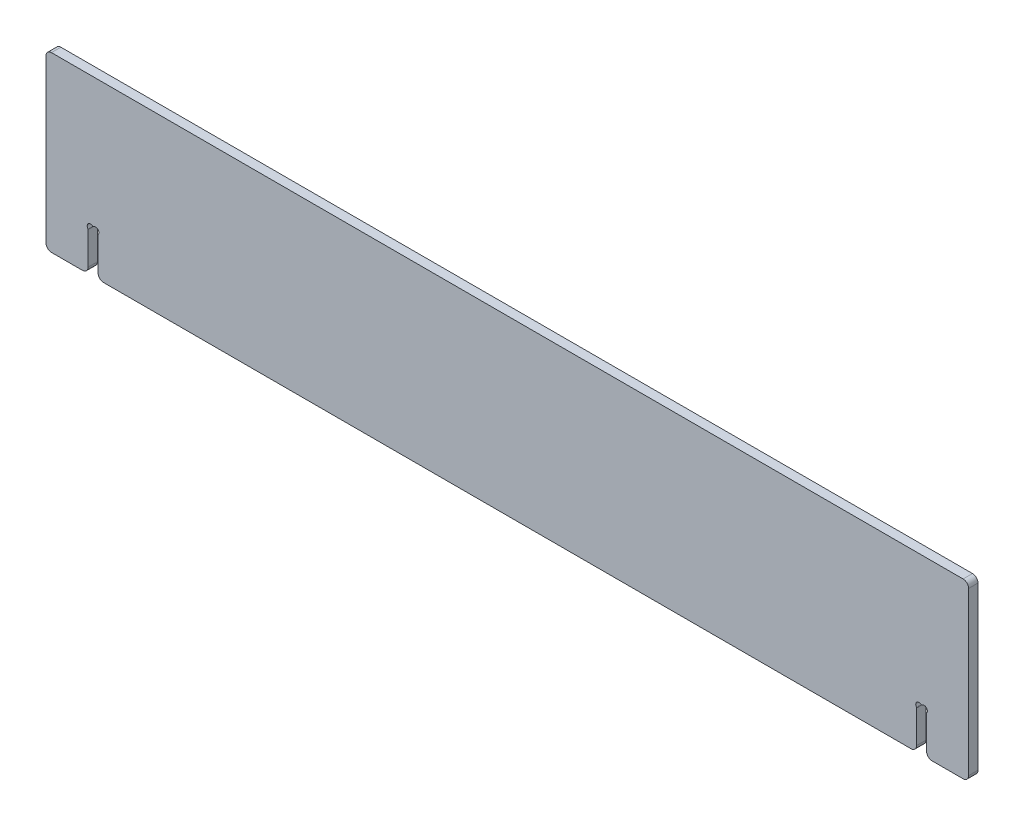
ISO-10303-21;
HEADER;
FILE_DESCRIPTION(('STEP AP214'),'2;1');
FILE_NAME('part.step','',(''),(''),'','','');
FILE_SCHEMA(('AUTOMOTIVE_DESIGN { 1 0 10303 214 1 1 1 1 }'));
ENDSEC;
DATA;
#1=APPLICATION_CONTEXT('core data for automotive mechanical design processes');
#2=APPLICATION_PROTOCOL_DEFINITION('international standard','automotive_design',2000,#1);
#3=PRODUCT_CONTEXT('',#1,'mechanical');
#4=PRODUCT('Part','Part','',(#3));
#5=PRODUCT_RELATED_PRODUCT_CATEGORY('part','',(#4));
#6=PRODUCT_DEFINITION_FORMATION('','',#4);
#7=PRODUCT_DEFINITION_CONTEXT('part definition',#1,'design');
#8=PRODUCT_DEFINITION('design','',#6,#7);
#9=PRODUCT_DEFINITION_SHAPE('','',#8);
#10=(LENGTH_UNIT() NAMED_UNIT(*) SI_UNIT(.MILLI.,.METRE.));
#11=(NAMED_UNIT(*) PLANE_ANGLE_UNIT() SI_UNIT($,.RADIAN.));
#12=(NAMED_UNIT(*) SI_UNIT($,.STERADIAN.) SOLID_ANGLE_UNIT());
#13=UNCERTAINTY_MEASURE_WITH_UNIT(LENGTH_MEASURE(1.E-05),#10,'distance_accuracy_value','');
#14=(GEOMETRIC_REPRESENTATION_CONTEXT(3) GLOBAL_UNCERTAINTY_ASSIGNED_CONTEXT((#13)) GLOBAL_UNIT_ASSIGNED_CONTEXT((#10,
#11,#12)) REPRESENTATION_CONTEXT('',''));
#15=CARTESIAN_POINT('',(0.,0.,0.));
#16=DIRECTION('',(0.,0.,1.));
#17=DIRECTION('',(1.,0.,0.));
#18=AXIS2_PLACEMENT_3D('',#15,#16,#17);
#19=CARTESIAN_POINT('',(0.,220.8,12.));
#20=DIRECTION('',(0.,-1.,0.));
#21=DIRECTION('',(1.,0.,0.));
#22=AXIS2_PLACEMENT_3D('',#19,#20,#21);
#23=PLANE('',#22);
#24=DIRECTION('',(-1.,0.,0.));
#25=VECTOR('',#24,1.);
#26=CARTESIAN_POINT('',(0.,220.8,0.));
#27=LINE('',#26,#25);
#28=CARTESIAN_POINT('',(1170.,220.8,0.));
#29=VERTEX_POINT('',#28);
#30=CARTESIAN_POINT('',(6.9999999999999,220.8,0.));
#31=VERTEX_POINT('',#30);
#32=EDGE_CURVE('E47',#29,#31,#27,.T.);
#33=ORIENTED_EDGE('',*,*,#32,.T.);
#34=DIRECTION('',(0.,0.,-1.));
#35=VECTOR('',#34,1.);
#36=CARTESIAN_POINT('',(6.9999999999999,220.8,12.));
#37=LINE('',#36,#35);
#38=CARTESIAN_POINT('',(6.9999999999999,220.8,12.));
#39=VERTEX_POINT('',#38);
#40=EDGE_CURVE('E487',#31,#39,#37,.F.);
#41=ORIENTED_EDGE('',*,*,#40,.T.);
#42=DIRECTION('',(-1.,0.,0.));
#43=VECTOR('',#42,1.);
#44=CARTESIAN_POINT('',(0.,220.8,12.));
#45=LINE('',#44,#43);
#46=CARTESIAN_POINT('',(1170.,220.8,12.));
#47=VERTEX_POINT('',#46);
#48=EDGE_CURVE('E452',#47,#39,#45,.T.);
#49=ORIENTED_EDGE('',*,*,#48,.F.);
#50=DIRECTION('',(0.,0.,-1.));
#51=VECTOR('',#50,1.);
#52=CARTESIAN_POINT('',(1170.,220.8,12.));
#53=LINE('',#52,#51);
#54=EDGE_CURVE('E368',#29,#47,#53,.F.);
#55=ORIENTED_EDGE('',*,*,#54,.F.);
#56=EDGE_LOOP('',(#33,#41,#49,#55));
#57=FACE_BOUND('',#56,.T.);
#58=ADVANCED_FACE('F32',(#57),#23,.F.);
#59=CARTESIAN_POINT('',(0.,0.,12.));
#60=DIRECTION('',(0.,0.,-1.));
#61=DIRECTION('',(-1.,0.,0.));
#62=AXIS2_PLACEMENT_3D('',#59,#60,#61);
#63=PLANE('',#62);
#64=DIRECTION('',(0.,-1.,0.));
#65=VECTOR('',#64,1.);
#66=CARTESIAN_POINT('',(0.,0.,12.));
#67=LINE('',#66,#65);
#68=CARTESIAN_POINT('',(0.,213.8,12.));
#69=VERTEX_POINT('',#68);
#70=CARTESIAN_POINT('',(0.,7.00000000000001,12.));
#71=VERTEX_POINT('',#70);
#72=EDGE_CURVE('E446',#69,#71,#67,.T.);
#73=ORIENTED_EDGE('',*,*,#72,.T.);
#74=CARTESIAN_POINT('',(6.9999999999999,7.00000000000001,12.));
#75=DIRECTION('',(0.,0.,-1.));
#76=DIRECTION('',(-1.,0.,0.));
#77=AXIS2_PLACEMENT_3D('',#74,#75,#76);
#78=CIRCLE('',#77,7.);
#79=CARTESIAN_POINT('',(6.9999999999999,0.,12.));
#80=VERTEX_POINT('',#79);
#81=EDGE_CURVE('E454',#71,#80,#78,.F.);
#82=ORIENTED_EDGE('',*,*,#81,.T.);
#83=DIRECTION('',(1.,0.,0.));
#84=VECTOR('',#83,1.);
#85=CARTESIAN_POINT('',(0.,0.,12.));
#86=LINE('',#85,#84);
#87=CARTESIAN_POINT('',(46.5505408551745,0.,12.));
#88=VERTEX_POINT('',#87);
#89=EDGE_CURVE('E449',#80,#88,#86,.T.);
#90=ORIENTED_EDGE('',*,*,#89,.T.);
#91=CARTESIAN_POINT('',(46.5505408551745,7.00000000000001,12.));
#92=DIRECTION('',(0.,0.,-1.));
#93=DIRECTION('',(-1.,0.,0.));
#94=AXIS2_PLACEMENT_3D('',#91,#92,#93);
#95=CIRCLE('',#94,7.);
#96=CARTESIAN_POINT('',(53.5503570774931,6.94927669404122,12.));
#97=VERTEX_POINT('',#96);
#98=EDGE_CURVE('E462',#88,#97,#95,.F.);
#99=ORIENTED_EDGE('',*,*,#98,.T.);
#100=DIRECTION('',(-0.00724618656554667,-0.999973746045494,0.));
#101=VECTOR('',#100,1.);
#102=CARTESIAN_POINT('',(53.8529417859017,48.7059664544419,12.));
#103=LINE('',#102,#101);
#104=CARTESIAN_POINT('',(53.8529417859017,48.7059664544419,12.));
#105=VERTEX_POINT('',#104);
#106=EDGE_CURVE('E381',#105,#97,#103,.T.);
#107=ORIENTED_EDGE('',*,*,#106,.F.);
#108=CARTESIAN_POINT('',(52.6529732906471,48.7146618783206,12.));
#109=DIRECTION('',(0.,0.,-1.));
#110=DIRECTION('',(-1.,0.,0.));
#111=AXIS2_PLACEMENT_3D('',#108,#109,#110);
#112=CIRCLE('',#111,1.19999999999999);
#113=CARTESIAN_POINT('',(53.5619227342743,49.4981227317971,12.));
#114=VERTEX_POINT('',#113);
#115=EDGE_CURVE('E425',#114,#105,#112,.T.);
#116=ORIENTED_EDGE('',*,*,#115,.F.);
#117=CARTESIAN_POINT('',(56.6675000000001,52.1749473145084,12.));
#118=DIRECTION('',(0.,0.,1.));
#119=DIRECTION('',(1.,0.,0.));
#120=AXIS2_PLACEMENT_3D('',#117,#118,#119);
#121=CIRCLE('',#120,4.1);
#122=CARTESIAN_POINT('',(59.142842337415,55.4433842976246,12.));
#123=VERTEX_POINT('',#122);
#124=EDGE_CURVE('E422',#123,#114,#121,.T.);
#125=ORIENTED_EDGE('',*,*,#124,.F.);
#126=CARTESIAN_POINT('',(59.8673327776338,56.4000000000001,12.));
#127=DIRECTION('',(0.,0.,-1.));
#128=DIRECTION('',(1.,0.,0.));
#129=AXIS2_PLACEMENT_3D('',#126,#127,#128);
#130=CIRCLE('',#129,1.2);
#131=CARTESIAN_POINT('',(59.8673327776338,55.2,12.));
#132=VERTEX_POINT('',#131);
#133=EDGE_CURVE('E419',#132,#123,#130,.T.);
#134=ORIENTED_EDGE('',*,*,#133,.F.);
#135=DIRECTION('',(-1.,0.,0.));
#136=VECTOR('',#135,1.);
#137=CARTESIAN_POINT('',(59.8673327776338,55.2,12.));
#138=LINE('',#137,#136);
#139=CARTESIAN_POINT('',(60.1326672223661,55.2,12.));
#140=VERTEX_POINT('',#139);
#141=EDGE_CURVE('E416',#140,#132,#138,.T.);
#142=ORIENTED_EDGE('',*,*,#141,.F.);
#143=CARTESIAN_POINT('',(60.1326672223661,56.4000000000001,12.));
#144=DIRECTION('',(0.,0.,-1.));
#145=DIRECTION('',(-1.,0.,0.));
#146=AXIS2_PLACEMENT_3D('',#143,#144,#145);
#147=CIRCLE('',#146,1.2);
#148=CARTESIAN_POINT('',(60.8571576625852,55.4433842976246,12.));
#149=VERTEX_POINT('',#148);
#150=EDGE_CURVE('E413',#149,#140,#147,.T.);
#151=ORIENTED_EDGE('',*,*,#150,.F.);
#152=CARTESIAN_POINT('',(63.3325,52.1749473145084,12.));
#153=DIRECTION('',(0.,0.,1.));
#154=DIRECTION('',(-1.,0.,0.));
#155=AXIS2_PLACEMENT_3D('',#152,#153,#154);
#156=CIRCLE('',#155,4.1);
#157=CARTESIAN_POINT('',(66.4380772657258,49.4981227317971,12.));
#158=VERTEX_POINT('',#157);
#159=EDGE_CURVE('E410',#158,#149,#156,.T.);
#160=ORIENTED_EDGE('',*,*,#159,.F.);
#161=CARTESIAN_POINT('',(67.3470267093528,48.7146618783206,12.));
#162=DIRECTION('',(0.,0.,-1.));
#163=DIRECTION('',(1.,0.,0.));
#164=AXIS2_PLACEMENT_3D('',#161,#162,#163);
#165=CIRCLE('',#164,1.2);
#166=CARTESIAN_POINT('',(66.1470582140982,48.7059664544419,12.));
#167=VERTEX_POINT('',#166);
#168=EDGE_CURVE('E407',#167,#158,#165,.T.);
#169=ORIENTED_EDGE('',*,*,#168,.F.);
#170=DIRECTION('',(-0.00724618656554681,0.999973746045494,0.));
#171=VECTOR('',#170,1.);
#172=CARTESIAN_POINT('',(66.1470582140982,48.7059664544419,12.));
#173=LINE('',#172,#171);
#174=CARTESIAN_POINT('',(66.449642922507,6.94927669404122,12.));
#175=VERTEX_POINT('',#174);
#176=EDGE_CURVE('E377',#175,#167,#173,.T.);
#177=ORIENTED_EDGE('',*,*,#176,.F.);
#178=CARTESIAN_POINT('',(73.4494591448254,7.00000000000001,12.));
#179=DIRECTION('',(0.,0.,-1.));
#180=DIRECTION('',(-1.,0.,0.));
#181=AXIS2_PLACEMENT_3D('',#178,#179,#180);
#182=CIRCLE('',#181,7.);
#183=CARTESIAN_POINT('',(73.4494591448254,0.,12.));
#184=VERTEX_POINT('',#183);
#185=EDGE_CURVE('E466',#175,#184,#182,.F.);
#186=ORIENTED_EDGE('',*,*,#185,.T.);
#187=CARTESIAN_POINT('',(1103.55054085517,0.,12.));
#188=VERTEX_POINT('',#187);
#189=EDGE_CURVE('E448',#184,#188,#86,.T.);
#190=ORIENTED_EDGE('',*,*,#189,.T.);
#191=CARTESIAN_POINT('',(1103.55054085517,7.00000000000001,12.));
#192=DIRECTION('',(0.,0.,1.));
#193=DIRECTION('',(1.,0.,0.));
#194=AXIS2_PLACEMENT_3D('',#191,#192,#193);
#195=CIRCLE('',#194,7.);
#196=CARTESIAN_POINT('',(1110.55035707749,6.94927669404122,12.));
#197=VERTEX_POINT('',#196);
#198=EDGE_CURVE('E343',#197,#188,#195,.F.);
#199=ORIENTED_EDGE('',*,*,#198,.F.);
#200=DIRECTION('',(0.00724618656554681,0.999973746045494,0.));
#201=VECTOR('',#200,1.);
#202=CARTESIAN_POINT('',(1110.8529417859,48.7059664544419,12.));
#203=LINE('',#202,#201);
#204=CARTESIAN_POINT('',(1110.8529417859,48.7059664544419,12.));
#205=VERTEX_POINT('',#204);
#206=EDGE_CURVE('E288',#197,#205,#203,.T.);
#207=ORIENTED_EDGE('',*,*,#206,.T.);
#208=CARTESIAN_POINT('',(1109.65297329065,48.7146618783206,12.));
#209=DIRECTION('',(0.,0.,1.));
#210=DIRECTION('',(-1.,0.,0.));
#211=AXIS2_PLACEMENT_3D('',#208,#209,#210);
#212=CIRCLE('',#211,1.2);
#213=CARTESIAN_POINT('',(1110.56192273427,49.498122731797,12.));
#214=VERTEX_POINT('',#213);
#215=EDGE_CURVE('E291',#205,#214,#212,.T.);
#216=ORIENTED_EDGE('',*,*,#215,.T.);
#217=CARTESIAN_POINT('',(1113.6675,52.1749473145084,12.));
#218=DIRECTION('',(0.,0.,-1.));
#219=DIRECTION('',(1.,0.,0.));
#220=AXIS2_PLACEMENT_3D('',#217,#218,#219);
#221=CIRCLE('',#220,4.1);
#222=CARTESIAN_POINT('',(1116.14284233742,55.4433842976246,12.));
#223=VERTEX_POINT('',#222);
#224=EDGE_CURVE('E250',#214,#223,#221,.T.);
#225=ORIENTED_EDGE('',*,*,#224,.T.);
#226=CARTESIAN_POINT('',(1116.86733277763,56.4000000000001,12.));
#227=DIRECTION('',(0.,0.,1.));
#228=DIRECTION('',(1.,0.,0.));
#229=AXIS2_PLACEMENT_3D('',#226,#227,#228);
#230=CIRCLE('',#229,1.2);
#231=CARTESIAN_POINT('',(1116.86733277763,55.2,12.));
#232=VERTEX_POINT('',#231);
#233=EDGE_CURVE('E294',#223,#232,#230,.T.);
#234=ORIENTED_EDGE('',*,*,#233,.T.);
#235=DIRECTION('',(1.,0.,0.));
#236=VECTOR('',#235,1.);
#237=CARTESIAN_POINT('',(1117.13266722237,55.2,12.));
#238=LINE('',#237,#236);
#239=CARTESIAN_POINT('',(1117.13266722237,55.2,12.));
#240=VERTEX_POINT('',#239);
#241=EDGE_CURVE('E297',#232,#240,#238,.T.);
#242=ORIENTED_EDGE('',*,*,#241,.T.);
#243=CARTESIAN_POINT('',(1117.13266722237,56.4000000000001,12.));
#244=DIRECTION('',(0.,0.,1.));
#245=DIRECTION('',(-1.,0.,0.));
#246=AXIS2_PLACEMENT_3D('',#243,#244,#245);
#247=CIRCLE('',#246,1.2);
#248=CARTESIAN_POINT('',(1117.85715766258,55.4433842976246,12.));
#249=VERTEX_POINT('',#248);
#250=EDGE_CURVE('E300',#240,#249,#247,.T.);
#251=ORIENTED_EDGE('',*,*,#250,.T.);
#252=CARTESIAN_POINT('',(1120.3325,52.1749473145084,12.));
#253=DIRECTION('',(0.,0.,-1.));
#254=DIRECTION('',(-1.,0.,0.));
#255=AXIS2_PLACEMENT_3D('',#252,#253,#254);
#256=CIRCLE('',#255,4.1);
#257=CARTESIAN_POINT('',(1123.43807726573,49.498122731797,12.));
#258=VERTEX_POINT('',#257);
#259=EDGE_CURVE('E303',#249,#258,#256,.T.);
#260=ORIENTED_EDGE('',*,*,#259,.T.);
#261=CARTESIAN_POINT('',(1124.34702670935,48.7146618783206,12.));
#262=DIRECTION('',(0.,0.,1.));
#263=DIRECTION('',(1.,0.,0.));
#264=AXIS2_PLACEMENT_3D('',#261,#262,#263);
#265=CIRCLE('',#264,1.19999999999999);
#266=CARTESIAN_POINT('',(1123.1470582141,48.7059664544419,12.));
#267=VERTEX_POINT('',#266);
#268=EDGE_CURVE('E306',#258,#267,#265,.T.);
#269=ORIENTED_EDGE('',*,*,#268,.T.);
#270=DIRECTION('',(0.00724618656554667,-0.999973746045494,0.));
#271=VECTOR('',#270,1.);
#272=CARTESIAN_POINT('',(1123.1470582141,48.7059664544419,12.));
#273=LINE('',#272,#271);
#274=CARTESIAN_POINT('',(1123.44964292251,6.94927669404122,12.));
#275=VERTEX_POINT('',#274);
#276=EDGE_CURVE('E309',#267,#275,#273,.T.);
#277=ORIENTED_EDGE('',*,*,#276,.T.);
#278=CARTESIAN_POINT('',(1130.44945914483,7.00000000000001,12.));
#279=DIRECTION('',(0.,0.,1.));
#280=DIRECTION('',(1.,0.,0.));
#281=AXIS2_PLACEMENT_3D('',#278,#279,#280);
#282=CIRCLE('',#281,7.);
#283=CARTESIAN_POINT('',(1130.44945914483,0.,12.));
#284=VERTEX_POINT('',#283);
#285=EDGE_CURVE('E337',#284,#275,#282,.F.);
#286=ORIENTED_EDGE('',*,*,#285,.F.);
#287=DIRECTION('',(-1.,0.,0.));
#288=VECTOR('',#287,1.);
#289=CARTESIAN_POINT('',(1177.,0.,12.));
#290=LINE('',#289,#288);
#291=CARTESIAN_POINT('',(1170.,0.,12.));
#292=VERTEX_POINT('',#291);
#293=EDGE_CURVE('E327',#292,#284,#290,.T.);
#294=ORIENTED_EDGE('',*,*,#293,.F.);
#295=CARTESIAN_POINT('',(1170.,7.00000000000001,12.));
#296=DIRECTION('',(0.,0.,1.));
#297=DIRECTION('',(1.,0.,0.));
#298=AXIS2_PLACEMENT_3D('',#295,#296,#297);
#299=CIRCLE('',#298,7.);
#300=CARTESIAN_POINT('',(1177.,7.00000000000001,12.));
#301=VERTEX_POINT('',#300);
#302=EDGE_CURVE('E331',#301,#292,#299,.F.);
#303=ORIENTED_EDGE('',*,*,#302,.F.);
#304=DIRECTION('',(0.,-1.,0.));
#305=VECTOR('',#304,1.);
#306=CARTESIAN_POINT('',(1177.,0.,12.));
#307=LINE('',#306,#305);
#308=CARTESIAN_POINT('',(1177.,213.8,12.));
#309=VERTEX_POINT('',#308);
#310=EDGE_CURVE('E325',#309,#301,#307,.T.);
#311=ORIENTED_EDGE('',*,*,#310,.F.);
#312=CARTESIAN_POINT('',(1170.,213.8,12.));
#313=DIRECTION('',(0.,0.,1.));
#314=DIRECTION('',(1.,0.,0.));
#315=AXIS2_PLACEMENT_3D('',#312,#313,#314);
#316=CIRCLE('',#315,7.);
#317=EDGE_CURVE('E340',#47,#309,#316,.F.);
#318=ORIENTED_EDGE('',*,*,#317,.F.);
#319=ORIENTED_EDGE('',*,*,#48,.T.);
#320=CARTESIAN_POINT('',(6.9999999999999,213.8,12.));
#321=DIRECTION('',(0.,0.,-1.));
#322=DIRECTION('',(-1.,0.,0.));
#323=AXIS2_PLACEMENT_3D('',#320,#321,#322);
#324=CIRCLE('',#323,7.);
#325=EDGE_CURVE('E464',#39,#69,#324,.F.);
#326=ORIENTED_EDGE('',*,*,#325,.T.);
#327=EDGE_LOOP('',(#73,#82,#90,#99,#107,#116,#125,#134,#142,#151,#160,#169,#177,#186,#190,#199,
#207,#216,#225,#234,#242,#251,#260,#269,#277,#286,#294,#303,#311,#318,#319,#326));
#328=FACE_BOUND('',#327,.T.);
#329=ADVANCED_FACE('F501',(#328),#63,.F.);
#330=CARTESIAN_POINT('',(0.,0.,0.));
#331=DIRECTION('',(0.,0.,-1.));
#332=DIRECTION('',(-1.,0.,0.));
#333=AXIS2_PLACEMENT_3D('',#330,#331,#332);
#334=PLANE('',#333);
#335=CARTESIAN_POINT('',(6.9999999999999,7.00000000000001,0.));
#336=DIRECTION('',(0.,0.,-1.));
#337=DIRECTION('',(-1.,0.,0.));
#338=AXIS2_PLACEMENT_3D('',#335,#336,#337);
#339=CIRCLE('',#338,7.);
#340=CARTESIAN_POINT('',(6.9999999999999,0.,0.));
#341=VERTEX_POINT('',#340);
#342=CARTESIAN_POINT('',(0.,7.00000000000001,0.));
#343=VERTEX_POINT('',#342);
#344=EDGE_CURVE('E469',#341,#343,#339,.T.);
#345=ORIENTED_EDGE('',*,*,#344,.T.);
#346=DIRECTION('',(0.,-1.,0.));
#347=VECTOR('',#346,1.);
#348=CARTESIAN_POINT('',(0.,0.,0.));
#349=LINE('',#348,#347);
#350=CARTESIAN_POINT('',(0.,213.8,0.));
#351=VERTEX_POINT('',#350);
#352=EDGE_CURVE('E55',#351,#343,#349,.T.);
#353=ORIENTED_EDGE('',*,*,#352,.F.);
#354=CARTESIAN_POINT('',(6.9999999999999,213.8,0.));
#355=DIRECTION('',(0.,0.,-1.));
#356=DIRECTION('',(-1.,0.,0.));
#357=AXIS2_PLACEMENT_3D('',#354,#355,#356);
#358=CIRCLE('',#357,7.);
#359=EDGE_CURVE('E473',#351,#31,#358,.T.);
#360=ORIENTED_EDGE('',*,*,#359,.T.);
#361=ORIENTED_EDGE('',*,*,#32,.F.);
#362=CARTESIAN_POINT('',(1170.,213.8,0.));
#363=DIRECTION('',(0.,0.,1.));
#364=DIRECTION('',(1.,0.,0.));
#365=AXIS2_PLACEMENT_3D('',#362,#363,#364);
#366=CIRCLE('',#365,7.);
#367=CARTESIAN_POINT('',(1177.,213.8,0.));
#368=VERTEX_POINT('',#367);
#369=EDGE_CURVE('E352',#368,#29,#366,.T.);
#370=ORIENTED_EDGE('',*,*,#369,.F.);
#371=DIRECTION('',(0.,-1.,0.));
#372=VECTOR('',#371,1.);
#373=CARTESIAN_POINT('',(1177.,0.,0.));
#374=LINE('',#373,#372);
#375=CARTESIAN_POINT('',(1177.,7.00000000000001,0.));
#376=VERTEX_POINT('',#375);
#377=EDGE_CURVE('E314',#368,#376,#374,.T.);
#378=ORIENTED_EDGE('',*,*,#377,.T.);
#379=CARTESIAN_POINT('',(1170.,7.00000000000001,0.));
#380=DIRECTION('',(0.,0.,1.));
#381=DIRECTION('',(1.,0.,0.));
#382=AXIS2_PLACEMENT_3D('',#379,#380,#381);
#383=CIRCLE('',#382,7.);
#384=CARTESIAN_POINT('',(1170.,0.,0.));
#385=VERTEX_POINT('',#384);
#386=EDGE_CURVE('E346',#385,#376,#383,.T.);
#387=ORIENTED_EDGE('',*,*,#386,.F.);
#388=DIRECTION('',(-1.,0.,0.));
#389=VECTOR('',#388,1.);
#390=CARTESIAN_POINT('',(1177.,0.,0.));
#391=LINE('',#390,#389);
#392=CARTESIAN_POINT('',(1130.44945914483,0.,0.));
#393=VERTEX_POINT('',#392);
#394=EDGE_CURVE('E328',#385,#393,#391,.T.);
#395=ORIENTED_EDGE('',*,*,#394,.T.);
#396=CARTESIAN_POINT('',(1130.44945914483,7.00000000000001,0.));
#397=DIRECTION('',(0.,0.,1.));
#398=DIRECTION('',(1.,0.,0.));
#399=AXIS2_PLACEMENT_3D('',#396,#397,#398);
#400=CIRCLE('',#399,7.);
#401=CARTESIAN_POINT('',(1123.44964292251,6.94927669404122,0.));
#402=VERTEX_POINT('',#401);
#403=EDGE_CURVE('E349',#402,#393,#400,.T.);
#404=ORIENTED_EDGE('',*,*,#403,.F.);
#405=DIRECTION('',(0.00724618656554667,-0.999973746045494,0.));
#406=VECTOR('',#405,1.);
#407=CARTESIAN_POINT('',(1123.1470582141,48.7059664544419,0.));
#408=LINE('',#407,#406);
#409=CARTESIAN_POINT('',(1123.1470582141,48.7059664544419,0.));
#410=VERTEX_POINT('',#409);
#411=EDGE_CURVE('E285',#410,#402,#408,.T.);
#412=ORIENTED_EDGE('',*,*,#411,.F.);
#413=CARTESIAN_POINT('',(1124.34702670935,48.7146618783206,0.));
#414=DIRECTION('',(0.,0.,1.));
#415=DIRECTION('',(1.,0.,0.));
#416=AXIS2_PLACEMENT_3D('',#413,#414,#415);
#417=CIRCLE('',#416,1.19999999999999);
#418=CARTESIAN_POINT('',(1123.43807726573,49.498122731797,0.));
#419=VERTEX_POINT('',#418);
#420=EDGE_CURVE('E282',#419,#410,#417,.T.);
#421=ORIENTED_EDGE('',*,*,#420,.F.);
#422=CARTESIAN_POINT('',(1120.3325,52.1749473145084,0.));
#423=DIRECTION('',(0.,0.,-1.));
#424=DIRECTION('',(-1.,0.,0.));
#425=AXIS2_PLACEMENT_3D('',#422,#423,#424);
#426=CIRCLE('',#425,4.1);
#427=CARTESIAN_POINT('',(1117.85715766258,55.4433842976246,0.));
#428=VERTEX_POINT('',#427);
#429=EDGE_CURVE('E279',#428,#419,#426,.T.);
#430=ORIENTED_EDGE('',*,*,#429,.F.);
#431=CARTESIAN_POINT('',(1117.13266722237,56.4000000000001,0.));
#432=DIRECTION('',(0.,0.,1.));
#433=DIRECTION('',(-1.,0.,0.));
#434=AXIS2_PLACEMENT_3D('',#431,#432,#433);
#435=CIRCLE('',#434,1.2);
#436=CARTESIAN_POINT('',(1117.13266722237,55.2,0.));
#437=VERTEX_POINT('',#436);
#438=EDGE_CURVE('E276',#437,#428,#435,.T.);
#439=ORIENTED_EDGE('',*,*,#438,.F.);
#440=DIRECTION('',(1.,0.,0.));
#441=VECTOR('',#440,1.);
#442=CARTESIAN_POINT('',(1117.13266722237,55.2,0.));
#443=LINE('',#442,#441);
#444=CARTESIAN_POINT('',(1116.86733277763,55.2,0.));
#445=VERTEX_POINT('',#444);
#446=EDGE_CURVE('E270',#445,#437,#443,.T.);
#447=ORIENTED_EDGE('',*,*,#446,.F.);
#448=CARTESIAN_POINT('',(1116.86733277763,56.4000000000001,0.));
#449=DIRECTION('',(0.,0.,1.));
#450=DIRECTION('',(1.,0.,0.));
#451=AXIS2_PLACEMENT_3D('',#448,#449,#450);
#452=CIRCLE('',#451,1.2);
#453=CARTESIAN_POINT('',(1116.14284233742,55.4433842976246,0.));
#454=VERTEX_POINT('',#453);
#455=EDGE_CURVE('E268',#454,#445,#452,.T.);
#456=ORIENTED_EDGE('',*,*,#455,.F.);
#457=CARTESIAN_POINT('',(1113.6675,52.1749473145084,0.));
#458=DIRECTION('',(0.,0.,-1.));
#459=DIRECTION('',(1.,0.,0.));
#460=AXIS2_PLACEMENT_3D('',#457,#458,#459);
#461=CIRCLE('',#460,4.1);
#462=CARTESIAN_POINT('',(1110.56192273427,49.498122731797,0.));
#463=VERTEX_POINT('',#462);
#464=EDGE_CURVE('E247',#463,#454,#461,.T.);
#465=ORIENTED_EDGE('',*,*,#464,.F.);
#466=CARTESIAN_POINT('',(1109.65297329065,48.7146618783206,0.));
#467=DIRECTION('',(0.,0.,1.));
#468=DIRECTION('',(-1.,0.,0.));
#469=AXIS2_PLACEMENT_3D('',#466,#467,#468);
#470=CIRCLE('',#469,1.2);
#471=CARTESIAN_POINT('',(1110.8529417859,48.7059664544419,0.));
#472=VERTEX_POINT('',#471);
#473=EDGE_CURVE('E258',#472,#463,#470,.T.);
#474=ORIENTED_EDGE('',*,*,#473,.F.);
#475=DIRECTION('',(0.00724618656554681,0.999973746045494,0.));
#476=VECTOR('',#475,1.);
#477=CARTESIAN_POINT('',(1110.8529417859,48.7059664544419,0.));
#478=LINE('',#477,#476);
#479=CARTESIAN_POINT('',(1110.55035707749,6.94927669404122,0.));
#480=VERTEX_POINT('',#479);
#481=EDGE_CURVE('E263',#480,#472,#478,.T.);
#482=ORIENTED_EDGE('',*,*,#481,.F.);
#483=CARTESIAN_POINT('',(1103.55054085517,7.00000000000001,0.));
#484=DIRECTION('',(0.,0.,1.));
#485=DIRECTION('',(1.,0.,0.));
#486=AXIS2_PLACEMENT_3D('',#483,#484,#485);
#487=CIRCLE('',#486,7.);
#488=CARTESIAN_POINT('',(1103.55054085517,0.,0.));
#489=VERTEX_POINT('',#488);
#490=EDGE_CURVE('E355',#489,#480,#487,.T.);
#491=ORIENTED_EDGE('',*,*,#490,.F.);
#492=DIRECTION('',(1.,0.,0.));
#493=VECTOR('',#492,1.);
#494=CARTESIAN_POINT('',(0.,0.,0.));
#495=LINE('',#494,#493);
#496=CARTESIAN_POINT('',(73.4494591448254,0.,0.));
#497=VERTEX_POINT('',#496);
#498=EDGE_CURVE('E456',#497,#489,#495,.T.);
#499=ORIENTED_EDGE('',*,*,#498,.F.);
#500=CARTESIAN_POINT('',(73.4494591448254,7.00000000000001,0.));
#501=DIRECTION('',(0.,0.,-1.));
#502=DIRECTION('',(-1.,0.,0.));
#503=AXIS2_PLACEMENT_3D('',#500,#501,#502);
#504=CIRCLE('',#503,7.);
#505=CARTESIAN_POINT('',(66.449642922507,6.94927669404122,0.));
#506=VERTEX_POINT('',#505);
#507=EDGE_CURVE('E475',#497,#506,#504,.T.);
#508=ORIENTED_EDGE('',*,*,#507,.T.);
#509=DIRECTION('',(-0.00724618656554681,0.999973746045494,0.));
#510=VECTOR('',#509,1.);
#511=CARTESIAN_POINT('',(66.1470582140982,48.7059664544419,0.));
#512=LINE('',#511,#510);
#513=CARTESIAN_POINT('',(66.1470582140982,48.7059664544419,0.));
#514=VERTEX_POINT('',#513);
#515=EDGE_CURVE('E378',#506,#514,#512,.T.);
#516=ORIENTED_EDGE('',*,*,#515,.T.);
#517=CARTESIAN_POINT('',(67.3470267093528,48.7146618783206,0.));
#518=DIRECTION('',(0.,0.,-1.));
#519=DIRECTION('',(1.,0.,0.));
#520=AXIS2_PLACEMENT_3D('',#517,#518,#519);
#521=CIRCLE('',#520,1.2);
#522=CARTESIAN_POINT('',(66.4380772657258,49.4981227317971,0.));
#523=VERTEX_POINT('',#522);
#524=EDGE_CURVE('E380',#514,#523,#521,.T.);
#525=ORIENTED_EDGE('',*,*,#524,.T.);
#526=CARTESIAN_POINT('',(63.3325,52.1749473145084,0.));
#527=DIRECTION('',(0.,0.,1.));
#528=DIRECTION('',(-1.,0.,0.));
#529=AXIS2_PLACEMENT_3D('',#526,#527,#528);
#530=CIRCLE('',#529,4.1);
#531=CARTESIAN_POINT('',(60.8571576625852,55.4433842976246,0.));
#532=VERTEX_POINT('',#531);
#533=EDGE_CURVE('E384',#523,#532,#530,.T.);
#534=ORIENTED_EDGE('',*,*,#533,.T.);
#535=CARTESIAN_POINT('',(60.1326672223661,56.4000000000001,0.));
#536=DIRECTION('',(0.,0.,-1.));
#537=DIRECTION('',(-1.,0.,0.));
#538=AXIS2_PLACEMENT_3D('',#535,#536,#537);
#539=CIRCLE('',#538,1.2);
#540=CARTESIAN_POINT('',(60.1326672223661,55.2,0.));
#541=VERTEX_POINT('',#540);
#542=EDGE_CURVE('E387',#532,#541,#539,.T.);
#543=ORIENTED_EDGE('',*,*,#542,.T.);
#544=DIRECTION('',(-1.,0.,0.));
#545=VECTOR('',#544,1.);
#546=CARTESIAN_POINT('',(59.8673327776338,55.2,0.));
#547=LINE('',#546,#545);
#548=CARTESIAN_POINT('',(59.8673327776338,55.2,0.));
#549=VERTEX_POINT('',#548);
#550=EDGE_CURVE('E390',#541,#549,#547,.T.);
#551=ORIENTED_EDGE('',*,*,#550,.T.);
#552=CARTESIAN_POINT('',(59.8673327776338,56.4000000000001,0.));
#553=DIRECTION('',(0.,0.,-1.));
#554=DIRECTION('',(1.,0.,0.));
#555=AXIS2_PLACEMENT_3D('',#552,#553,#554);
#556=CIRCLE('',#555,1.2);
#557=CARTESIAN_POINT('',(59.142842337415,55.4433842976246,0.));
#558=VERTEX_POINT('',#557);
#559=EDGE_CURVE('E393',#549,#558,#556,.T.);
#560=ORIENTED_EDGE('',*,*,#559,.T.);
#561=CARTESIAN_POINT('',(56.6675000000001,52.1749473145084,0.));
#562=DIRECTION('',(0.,0.,1.));
#563=DIRECTION('',(1.,0.,0.));
#564=AXIS2_PLACEMENT_3D('',#561,#562,#563);
#565=CIRCLE('',#564,4.1);
#566=CARTESIAN_POINT('',(53.5619227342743,49.4981227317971,0.));
#567=VERTEX_POINT('',#566);
#568=EDGE_CURVE('E396',#558,#567,#565,.T.);
#569=ORIENTED_EDGE('',*,*,#568,.T.);
#570=CARTESIAN_POINT('',(52.6529732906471,48.7146618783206,0.));
#571=DIRECTION('',(0.,0.,-1.));
#572=DIRECTION('',(-1.,0.,0.));
#573=AXIS2_PLACEMENT_3D('',#570,#571,#572);
#574=CIRCLE('',#573,1.19999999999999);
#575=CARTESIAN_POINT('',(53.8529417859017,48.7059664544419,0.));
#576=VERTEX_POINT('',#575);
#577=EDGE_CURVE('E399',#567,#576,#574,.T.);
#578=ORIENTED_EDGE('',*,*,#577,.T.);
#579=DIRECTION('',(-0.00724618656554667,-0.999973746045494,0.));
#580=VECTOR('',#579,1.);
#581=CARTESIAN_POINT('',(53.8529417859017,48.7059664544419,0.));
#582=LINE('',#581,#580);
#583=CARTESIAN_POINT('',(53.5503570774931,6.94927669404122,0.));
#584=VERTEX_POINT('',#583);
#585=EDGE_CURVE('E402',#576,#584,#582,.T.);
#586=ORIENTED_EDGE('',*,*,#585,.T.);
#587=CARTESIAN_POINT('',(46.5505408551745,7.00000000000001,0.));
#588=DIRECTION('',(0.,0.,-1.));
#589=DIRECTION('',(-1.,0.,0.));
#590=AXIS2_PLACEMENT_3D('',#587,#588,#589);
#591=CIRCLE('',#590,7.);
#592=CARTESIAN_POINT('',(46.5505408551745,0.,0.));
#593=VERTEX_POINT('',#592);
#594=EDGE_CURVE('E471',#584,#593,#591,.T.);
#595=ORIENTED_EDGE('',*,*,#594,.T.);
#596=EDGE_CURVE('E457',#341,#593,#495,.T.);
#597=ORIENTED_EDGE('',*,*,#596,.F.);
#598=EDGE_LOOP('',(#345,#353,#360,#361,#370,#378,#387,#395,#404,#412,#421,#430,#439,#447,#456,
#465,#474,#482,#491,#499,#508,#516,#525,#534,#543,#551,#560,#569,#578,#586,#595,#597));
#599=FACE_BOUND('',#598,.T.);
#600=ADVANCED_FACE('F265',(#599),#334,.T.);
#601=CARTESIAN_POINT('',(0.,0.,12.));
#602=DIRECTION('',(0.,1.,0.));
#603=DIRECTION('',(0.,0.,1.));
#604=AXIS2_PLACEMENT_3D('',#601,#602,#603);
#605=PLANE('',#604);
#606=ORIENTED_EDGE('',*,*,#596,.T.);
#607=DIRECTION('',(0.,0.,1.));
#608=VECTOR('',#607,1.);
#609=CARTESIAN_POINT('',(46.5505408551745,0.,12.));
#610=LINE('',#609,#608);
#611=EDGE_CURVE('E40',#593,#88,#610,.T.);
#612=ORIENTED_EDGE('',*,*,#611,.T.);
#613=ORIENTED_EDGE('',*,*,#89,.F.);
#614=DIRECTION('',(0.,0.,-1.));
#615=VECTOR('',#614,1.);
#616=CARTESIAN_POINT('',(6.9999999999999,0.,12.));
#617=LINE('',#616,#615);
#618=EDGE_CURVE('E489',#80,#341,#617,.T.);
#619=ORIENTED_EDGE('',*,*,#618,.T.);
#620=EDGE_LOOP('',(#606,#612,#613,#619));
#621=FACE_BOUND('',#620,.T.);
#622=ADVANCED_FACE('F495',(#621),#605,.F.);
#623=CARTESIAN_POINT('',(0.,0.,12.));
#624=DIRECTION('',(1.,0.,0.));
#625=DIRECTION('',(0.,0.,-1.));
#626=AXIS2_PLACEMENT_3D('',#623,#624,#625);
#627=PLANE('',#626);
#628=DIRECTION('',(0.,0.,-1.));
#629=VECTOR('',#628,1.);
#630=CARTESIAN_POINT('',(0.,7.00000000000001,12.));
#631=LINE('',#630,#629);
#632=EDGE_CURVE('E483',#343,#71,#631,.F.);
#633=ORIENTED_EDGE('',*,*,#632,.T.);
#634=ORIENTED_EDGE('',*,*,#72,.F.);
#635=DIRECTION('',(0.,0.,-1.));
#636=VECTOR('',#635,1.);
#637=CARTESIAN_POINT('',(0.,213.8,12.));
#638=LINE('',#637,#636);
#639=EDGE_CURVE('E485',#69,#351,#638,.T.);
#640=ORIENTED_EDGE('',*,*,#639,.T.);
#641=ORIENTED_EDGE('',*,*,#352,.T.);
#642=EDGE_LOOP('',(#633,#634,#640,#641));
#643=FACE_BOUND('',#642,.T.);
#644=ADVANCED_FACE('F607',(#643),#627,.F.);
#645=DIRECTION('',(0.,0.,1.));
#646=VECTOR('',#645,1.);
#647=CARTESIAN_POINT('',(1103.55054085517,0.,12.));
#648=LINE('',#647,#646);
#649=EDGE_CURVE('E360',#188,#489,#648,.F.);
#650=ORIENTED_EDGE('',*,*,#649,.F.);
#651=ORIENTED_EDGE('',*,*,#189,.F.);
#652=DIRECTION('',(0.,0.,1.));
#653=VECTOR('',#652,1.);
#654=CARTESIAN_POINT('',(73.4494591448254,0.,12.));
#655=LINE('',#654,#653);
#656=EDGE_CURVE('E480',#184,#497,#655,.F.);
#657=ORIENTED_EDGE('',*,*,#656,.T.);
#658=ORIENTED_EDGE('',*,*,#498,.T.);
#659=EDGE_LOOP('',(#650,#651,#657,#658));
#660=FACE_BOUND('',#659,.T.);
#661=ADVANCED_FACE('F556',(#660),#605,.F.);
#662=CARTESIAN_POINT('',(53.8529417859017,48.7059664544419,0.));
#663=DIRECTION('',(-0.999973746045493,0.00724618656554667,0.));
#664=DIRECTION('',(-0.00724618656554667,-0.999973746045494,0.));
#665=AXIS2_PLACEMENT_3D('',#662,#663,#664);
#666=PLANE('',#665);
#667=ORIENTED_EDGE('',*,*,#106,.T.);
#668=DIRECTION('',(0.,0.,1.));
#669=VECTOR('',#668,1.);
#670=CARTESIAN_POINT('',(53.5503570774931,6.94927669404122,0.));
#671=LINE('',#670,#669);
#672=EDGE_CURVE('E11',#97,#584,#671,.F.);
#673=ORIENTED_EDGE('',*,*,#672,.T.);
#674=ORIENTED_EDGE('',*,*,#585,.F.);
#675=DIRECTION('',(0.,0.,1.));
#676=VECTOR('',#675,1.);
#677=CARTESIAN_POINT('',(53.8529417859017,48.7059664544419,0.));
#678=LINE('',#677,#676);
#679=EDGE_CURVE('E430',#576,#105,#678,.T.);
#680=ORIENTED_EDGE('',*,*,#679,.T.);
#681=EDGE_LOOP('',(#667,#673,#674,#680));
#682=FACE_BOUND('',#681,.T.);
#683=ADVANCED_FACE('F511',(#682),#666,.F.);
#684=CARTESIAN_POINT('',(52.6529732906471,48.7146618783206,0.));
#685=DIRECTION('',(0.,0.,1.));
#686=DIRECTION('',(1.,0.,0.));
#687=AXIS2_PLACEMENT_3D('',#684,#685,#686);
#688=CYLINDRICAL_SURFACE('',#687,1.19999999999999);
#689=ORIENTED_EDGE('',*,*,#115,.T.);
#690=ORIENTED_EDGE('',*,*,#679,.F.);
#691=ORIENTED_EDGE('',*,*,#577,.F.);
#692=DIRECTION('',(0.,0.,1.));
#693=VECTOR('',#692,1.);
#694=CARTESIAN_POINT('',(53.5619227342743,49.4981227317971,0.));
#695=LINE('',#694,#693);
#696=EDGE_CURVE('E432',#567,#114,#695,.T.);
#697=ORIENTED_EDGE('',*,*,#696,.T.);
#698=EDGE_LOOP('',(#689,#690,#691,#697));
#699=FACE_BOUND('',#698,.T.);
#700=ADVANCED_FACE('F516',(#699),#688,.T.);
#701=CARTESIAN_POINT('',(56.6675000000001,52.1749473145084,0.));
#702=DIRECTION('',(0.,0.,1.));
#703=DIRECTION('',(1.,0.,0.));
#704=AXIS2_PLACEMENT_3D('',#701,#702,#703);
#705=CYLINDRICAL_SURFACE('',#704,4.1);
#706=ORIENTED_EDGE('',*,*,#124,.T.);
#707=ORIENTED_EDGE('',*,*,#696,.F.);
#708=ORIENTED_EDGE('',*,*,#568,.F.);
#709=DIRECTION('',(0.,0.,1.));
#710=VECTOR('',#709,1.);
#711=CARTESIAN_POINT('',(59.142842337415,55.4433842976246,0.));
#712=LINE('',#711,#710);
#713=EDGE_CURVE('E434',#558,#123,#712,.T.);
#714=ORIENTED_EDGE('',*,*,#713,.T.);
#715=EDGE_LOOP('',(#706,#707,#708,#714));
#716=FACE_BOUND('',#715,.T.);
#717=ADVANCED_FACE('F520',(#716),#705,.F.);
#718=CARTESIAN_POINT('',(59.8673327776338,56.4000000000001,0.));
#719=DIRECTION('',(0.,0.,1.));
#720=DIRECTION('',(1.,0.,0.));
#721=AXIS2_PLACEMENT_3D('',#718,#719,#720);
#722=CYLINDRICAL_SURFACE('',#721,1.2);
#723=ORIENTED_EDGE('',*,*,#133,.T.);
#724=ORIENTED_EDGE('',*,*,#713,.F.);
#725=ORIENTED_EDGE('',*,*,#559,.F.);
#726=DIRECTION('',(0.,0.,1.));
#727=VECTOR('',#726,1.);
#728=CARTESIAN_POINT('',(59.8673327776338,55.2,0.));
#729=LINE('',#728,#727);
#730=EDGE_CURVE('E436',#549,#132,#729,.T.);
#731=ORIENTED_EDGE('',*,*,#730,.T.);
#732=EDGE_LOOP('',(#723,#724,#725,#731));
#733=FACE_BOUND('',#732,.T.);
#734=ADVANCED_FACE('F523',(#733),#722,.T.);
#735=CARTESIAN_POINT('',(59.8673327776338,55.2,0.));
#736=DIRECTION('',(0.,1.,0.));
#737=DIRECTION('',(0.,0.,1.));
#738=AXIS2_PLACEMENT_3D('',#735,#736,#737);
#739=PLANE('',#738);
#740=ORIENTED_EDGE('',*,*,#141,.T.);
#741=ORIENTED_EDGE('',*,*,#730,.F.);
#742=ORIENTED_EDGE('',*,*,#550,.F.);
#743=DIRECTION('',(0.,0.,1.));
#744=VECTOR('',#743,1.);
#745=CARTESIAN_POINT('',(60.1326672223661,55.2,0.));
#746=LINE('',#745,#744);
#747=EDGE_CURVE('E438',#541,#140,#746,.T.);
#748=ORIENTED_EDGE('',*,*,#747,.T.);
#749=EDGE_LOOP('',(#740,#741,#742,#748));
#750=FACE_BOUND('',#749,.T.);
#751=ADVANCED_FACE('F528',(#750),#739,.F.);
#752=CARTESIAN_POINT('',(60.1326672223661,56.4000000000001,0.));
#753=DIRECTION('',(0.,0.,1.));
#754=DIRECTION('',(1.,0.,0.));
#755=AXIS2_PLACEMENT_3D('',#752,#753,#754);
#756=CYLINDRICAL_SURFACE('',#755,1.2);
#757=ORIENTED_EDGE('',*,*,#150,.T.);
#758=ORIENTED_EDGE('',*,*,#747,.F.);
#759=ORIENTED_EDGE('',*,*,#542,.F.);
#760=DIRECTION('',(0.,0.,1.));
#761=VECTOR('',#760,1.);
#762=CARTESIAN_POINT('',(60.8571576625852,55.4433842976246,0.));
#763=LINE('',#762,#761);
#764=EDGE_CURVE('E440',#532,#149,#763,.T.);
#765=ORIENTED_EDGE('',*,*,#764,.T.);
#766=EDGE_LOOP('',(#757,#758,#759,#765));
#767=FACE_BOUND('',#766,.T.);
#768=ADVANCED_FACE('F532',(#767),#756,.T.);
#769=CARTESIAN_POINT('',(63.3325,52.1749473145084,0.));
#770=DIRECTION('',(0.,0.,1.));
#771=DIRECTION('',(1.,0.,0.));
#772=AXIS2_PLACEMENT_3D('',#769,#770,#771);
#773=CYLINDRICAL_SURFACE('',#772,4.1);
#774=ORIENTED_EDGE('',*,*,#159,.T.);
#775=ORIENTED_EDGE('',*,*,#764,.F.);
#776=ORIENTED_EDGE('',*,*,#533,.F.);
#777=DIRECTION('',(0.,0.,1.));
#778=VECTOR('',#777,1.);
#779=CARTESIAN_POINT('',(66.4380772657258,49.4981227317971,0.));
#780=LINE('',#779,#778);
#781=EDGE_CURVE('E442',#523,#158,#780,.T.);
#782=ORIENTED_EDGE('',*,*,#781,.T.);
#783=EDGE_LOOP('',(#774,#775,#776,#782));
#784=FACE_BOUND('',#783,.T.);
#785=ADVANCED_FACE('F535',(#784),#773,.F.);
#786=CARTESIAN_POINT('',(67.3470267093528,48.7146618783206,0.));
#787=DIRECTION('',(0.,0.,1.));
#788=DIRECTION('',(1.,0.,0.));
#789=AXIS2_PLACEMENT_3D('',#786,#787,#788);
#790=CYLINDRICAL_SURFACE('',#789,1.2);
#791=ORIENTED_EDGE('',*,*,#168,.T.);
#792=ORIENTED_EDGE('',*,*,#781,.F.);
#793=ORIENTED_EDGE('',*,*,#524,.F.);
#794=DIRECTION('',(0.,0.,1.));
#795=VECTOR('',#794,1.);
#796=CARTESIAN_POINT('',(66.1470582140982,48.7059664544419,0.));
#797=LINE('',#796,#795);
#798=EDGE_CURVE('E405',#514,#167,#797,.T.);
#799=ORIENTED_EDGE('',*,*,#798,.T.);
#800=EDGE_LOOP('',(#791,#792,#793,#799));
#801=FACE_BOUND('',#800,.T.);
#802=ADVANCED_FACE('F539',(#801),#790,.T.);
#803=CARTESIAN_POINT('',(66.1470582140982,48.7059664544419,0.));
#804=DIRECTION('',(0.999973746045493,0.00724618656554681,0.));
#805=DIRECTION('',(-0.00724618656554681,0.999973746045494,0.));
#806=AXIS2_PLACEMENT_3D('',#803,#804,#805);
#807=PLANE('',#806);
#808=ORIENTED_EDGE('',*,*,#515,.F.);
#809=DIRECTION('',(0.,0.,1.));
#810=VECTOR('',#809,1.);
#811=CARTESIAN_POINT('',(66.449642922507,6.94927669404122,0.));
#812=LINE('',#811,#810);
#813=EDGE_CURVE('E477',#506,#175,#812,.T.);
#814=ORIENTED_EDGE('',*,*,#813,.T.);
#815=ORIENTED_EDGE('',*,*,#176,.T.);
#816=ORIENTED_EDGE('',*,*,#798,.F.);
#817=EDGE_LOOP('',(#808,#814,#815,#816));
#818=FACE_BOUND('',#817,.T.);
#819=ADVANCED_FACE('F544',(#818),#807,.F.);
#820=CARTESIAN_POINT('',(73.4494591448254,7.00000000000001,0.));
#821=DIRECTION('',(0.,0.,1.));
#822=DIRECTION('',(1.,0.,0.));
#823=AXIS2_PLACEMENT_3D('',#820,#821,#822);
#824=CYLINDRICAL_SURFACE('',#823,7.);
#825=ORIENTED_EDGE('',*,*,#507,.F.);
#826=ORIENTED_EDGE('',*,*,#656,.F.);
#827=ORIENTED_EDGE('',*,*,#185,.F.);
#828=ORIENTED_EDGE('',*,*,#813,.F.);
#829=EDGE_LOOP('',(#825,#826,#827,#828));
#830=FACE_BOUND('',#829,.T.);
#831=ADVANCED_FACE('F548',(#830),#824,.T.);
#832=CARTESIAN_POINT('',(6.9999999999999,213.8,12.));
#833=DIRECTION('',(0.,0.,-1.));
#834=DIRECTION('',(-1.,0.,0.));
#835=AXIS2_PLACEMENT_3D('',#832,#833,#834);
#836=CYLINDRICAL_SURFACE('',#835,7.);
#837=ORIENTED_EDGE('',*,*,#325,.F.);
#838=ORIENTED_EDGE('',*,*,#40,.F.);
#839=ORIENTED_EDGE('',*,*,#359,.F.);
#840=ORIENTED_EDGE('',*,*,#639,.F.);
#841=EDGE_LOOP('',(#837,#838,#839,#840));
#842=FACE_BOUND('',#841,.T.);
#843=ADVANCED_FACE('F608',(#842),#836,.T.);
#844=CARTESIAN_POINT('',(46.5505408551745,7.00000000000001,12.));
#845=DIRECTION('',(0.,0.,1.));
#846=DIRECTION('',(1.,0.,0.));
#847=AXIS2_PLACEMENT_3D('',#844,#845,#846);
#848=CYLINDRICAL_SURFACE('',#847,7.);
#849=ORIENTED_EDGE('',*,*,#594,.F.);
#850=ORIENTED_EDGE('',*,*,#672,.F.);
#851=ORIENTED_EDGE('',*,*,#98,.F.);
#852=ORIENTED_EDGE('',*,*,#611,.F.);
#853=EDGE_LOOP('',(#849,#850,#851,#852));
#854=FACE_BOUND('',#853,.T.);
#855=ADVANCED_FACE('F509',(#854),#848,.T.);
#856=CARTESIAN_POINT('',(6.9999999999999,7.00000000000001,12.));
#857=DIRECTION('',(0.,0.,-1.));
#858=DIRECTION('',(-1.,0.,0.));
#859=AXIS2_PLACEMENT_3D('',#856,#857,#858);
#860=CYLINDRICAL_SURFACE('',#859,7.);
#861=ORIENTED_EDGE('',*,*,#81,.F.);
#862=ORIENTED_EDGE('',*,*,#632,.F.);
#863=ORIENTED_EDGE('',*,*,#344,.F.);
#864=ORIENTED_EDGE('',*,*,#618,.F.);
#865=EDGE_LOOP('',(#861,#862,#863,#864));
#866=FACE_BOUND('',#865,.T.);
#867=ADVANCED_FACE('F34',(#866),#860,.T.);
#868=CARTESIAN_POINT('',(1177.,0.,12.));
#869=DIRECTION('',(0.,1.,0.));
#870=DIRECTION('',(0.,0.,1.));
#871=AXIS2_PLACEMENT_3D('',#868,#869,#870);
#872=PLANE('',#871);
#873=ORIENTED_EDGE('',*,*,#394,.F.);
#874=DIRECTION('',(0.,0.,-1.));
#875=VECTOR('',#874,1.);
#876=CARTESIAN_POINT('',(1170.,0.,12.));
#877=LINE('',#876,#875);
#878=EDGE_CURVE('E371',#292,#385,#877,.T.);
#879=ORIENTED_EDGE('',*,*,#878,.F.);
#880=ORIENTED_EDGE('',*,*,#293,.T.);
#881=DIRECTION('',(0.,0.,1.));
#882=VECTOR('',#881,1.);
#883=CARTESIAN_POINT('',(1130.44945914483,0.,12.));
#884=LINE('',#883,#882);
#885=EDGE_CURVE('E373',#393,#284,#884,.T.);
#886=ORIENTED_EDGE('',*,*,#885,.F.);
#887=EDGE_LOOP('',(#873,#879,#880,#886));
#888=FACE_BOUND('',#887,.T.);
#889=ADVANCED_FACE('F590',(#888),#872,.F.);
#890=CARTESIAN_POINT('',(1177.,0.,12.));
#891=DIRECTION('',(-1.,0.,0.));
#892=DIRECTION('',(0.,0.,-1.));
#893=AXIS2_PLACEMENT_3D('',#890,#891,#892);
#894=PLANE('',#893);
#895=DIRECTION('',(0.,0.,-1.));
#896=VECTOR('',#895,1.);
#897=CARTESIAN_POINT('',(1177.,7.00000000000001,12.));
#898=LINE('',#897,#896);
#899=EDGE_CURVE('E363',#376,#301,#898,.F.);
#900=ORIENTED_EDGE('',*,*,#899,.F.);
#901=ORIENTED_EDGE('',*,*,#377,.F.);
#902=DIRECTION('',(0.,0.,-1.));
#903=VECTOR('',#902,1.);
#904=CARTESIAN_POINT('',(1177.,213.8,12.));
#905=LINE('',#904,#903);
#906=EDGE_CURVE('E366',#309,#368,#905,.T.);
#907=ORIENTED_EDGE('',*,*,#906,.F.);
#908=ORIENTED_EDGE('',*,*,#310,.T.);
#909=EDGE_LOOP('',(#900,#901,#907,#908));
#910=FACE_BOUND('',#909,.T.);
#911=ADVANCED_FACE('F598',(#910),#894,.F.);
#912=CARTESIAN_POINT('',(1123.1470582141,48.7059664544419,0.));
#913=DIRECTION('',(0.999973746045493,0.00724618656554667,0.));
#914=DIRECTION('',(0.00724618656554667,-0.999973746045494,0.));
#915=AXIS2_PLACEMENT_3D('',#912,#913,#914);
#916=PLANE('',#915);
#917=ORIENTED_EDGE('',*,*,#276,.F.);
#918=DIRECTION('',(0.,0.,1.));
#919=VECTOR('',#918,1.);
#920=CARTESIAN_POINT('',(1123.1470582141,48.7059664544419,0.));
#921=LINE('',#920,#919);
#922=EDGE_CURVE('E312',#410,#267,#921,.T.);
#923=ORIENTED_EDGE('',*,*,#922,.F.);
#924=ORIENTED_EDGE('',*,*,#411,.T.);
#925=DIRECTION('',(0.,0.,1.));
#926=VECTOR('',#925,1.);
#927=CARTESIAN_POINT('',(1123.44964292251,6.94927669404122,0.));
#928=LINE('',#927,#926);
#929=EDGE_CURVE('E375',#275,#402,#928,.F.);
#930=ORIENTED_EDGE('',*,*,#929,.F.);
#931=EDGE_LOOP('',(#917,#923,#924,#930));
#932=FACE_BOUND('',#931,.T.);
#933=ADVANCED_FACE('F581',(#932),#916,.F.);
#934=CARTESIAN_POINT('',(1124.34702670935,48.7146618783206,0.));
#935=DIRECTION('',(0.,0.,1.));
#936=DIRECTION('',(-1.,0.,0.));
#937=AXIS2_PLACEMENT_3D('',#934,#935,#936);
#938=CYLINDRICAL_SURFACE('',#937,1.19999999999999);
#939=ORIENTED_EDGE('',*,*,#268,.F.);
#940=DIRECTION('',(0.,0.,1.));
#941=VECTOR('',#940,1.);
#942=CARTESIAN_POINT('',(1123.43807726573,49.498122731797,0.));
#943=LINE('',#942,#941);
#944=EDGE_CURVE('E315',#419,#258,#943,.T.);
#945=ORIENTED_EDGE('',*,*,#944,.F.);
#946=ORIENTED_EDGE('',*,*,#420,.T.);
#947=ORIENTED_EDGE('',*,*,#922,.T.);
#948=EDGE_LOOP('',(#939,#945,#946,#947));
#949=FACE_BOUND('',#948,.T.);
#950=ADVANCED_FACE('F577',(#949),#938,.T.);
#951=CARTESIAN_POINT('',(1120.3325,52.1749473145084,0.));
#952=DIRECTION('',(0.,0.,1.));
#953=DIRECTION('',(-1.,0.,0.));
#954=AXIS2_PLACEMENT_3D('',#951,#952,#953);
#955=CYLINDRICAL_SURFACE('',#954,4.1);
#956=ORIENTED_EDGE('',*,*,#259,.F.);
#957=DIRECTION('',(0.,0.,1.));
#958=VECTOR('',#957,1.);
#959=CARTESIAN_POINT('',(1117.85715766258,55.4433842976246,0.));
#960=LINE('',#959,#958);
#961=EDGE_CURVE('E317',#428,#249,#960,.T.);
#962=ORIENTED_EDGE('',*,*,#961,.F.);
#963=ORIENTED_EDGE('',*,*,#429,.T.);
#964=ORIENTED_EDGE('',*,*,#944,.T.);
#965=EDGE_LOOP('',(#956,#962,#963,#964));
#966=FACE_BOUND('',#965,.T.);
#967=ADVANCED_FACE('F573',(#966),#955,.F.);
#968=CARTESIAN_POINT('',(1117.13266722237,56.4000000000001,0.));
#969=DIRECTION('',(0.,0.,1.));
#970=DIRECTION('',(-1.,0.,0.));
#971=AXIS2_PLACEMENT_3D('',#968,#969,#970);
#972=CYLINDRICAL_SURFACE('',#971,1.2);
#973=ORIENTED_EDGE('',*,*,#250,.F.);
#974=DIRECTION('',(0.,0.,1.));
#975=VECTOR('',#974,1.);
#976=CARTESIAN_POINT('',(1117.13266722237,55.2,0.));
#977=LINE('',#976,#975);
#978=EDGE_CURVE('E319',#437,#240,#977,.T.);
#979=ORIENTED_EDGE('',*,*,#978,.F.);
#980=ORIENTED_EDGE('',*,*,#438,.T.);
#981=ORIENTED_EDGE('',*,*,#961,.T.);
#982=EDGE_LOOP('',(#973,#979,#980,#981));
#983=FACE_BOUND('',#982,.T.);
#984=ADVANCED_FACE('F569',(#983),#972,.T.);
#985=CARTESIAN_POINT('',(1117.13266722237,55.2,0.));
#986=DIRECTION('',(0.,1.,0.));
#987=DIRECTION('',(0.,0.,1.));
#988=AXIS2_PLACEMENT_3D('',#985,#986,#987);
#989=PLANE('',#988);
#990=ORIENTED_EDGE('',*,*,#241,.F.);
#991=DIRECTION('',(0.,0.,1.));
#992=VECTOR('',#991,1.);
#993=CARTESIAN_POINT('',(1116.86733277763,55.2,0.));
#994=LINE('',#993,#992);
#995=EDGE_CURVE('E321',#445,#232,#994,.T.);
#996=ORIENTED_EDGE('',*,*,#995,.F.);
#997=ORIENTED_EDGE('',*,*,#446,.T.);
#998=ORIENTED_EDGE('',*,*,#978,.T.);
#999=EDGE_LOOP('',(#990,#996,#997,#998));
#1000=FACE_BOUND('',#999,.T.);
#1001=ADVANCED_FACE('F565',(#1000),#989,.F.);
#1002=CARTESIAN_POINT('',(1116.86733277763,56.4000000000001,0.));
#1003=DIRECTION('',(0.,0.,1.));
#1004=DIRECTION('',(-1.,0.,0.));
#1005=AXIS2_PLACEMENT_3D('',#1002,#1003,#1004);
#1006=CYLINDRICAL_SURFACE('',#1005,1.2);
#1007=ORIENTED_EDGE('',*,*,#233,.F.);
#1008=DIRECTION('',(0.,0.,1.));
#1009=VECTOR('',#1008,1.);
#1010=CARTESIAN_POINT('',(1116.14284233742,55.4433842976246,0.));
#1011=LINE('',#1010,#1009);
#1012=EDGE_CURVE('E254',#454,#223,#1011,.T.);
#1013=ORIENTED_EDGE('',*,*,#1012,.F.);
#1014=ORIENTED_EDGE('',*,*,#455,.T.);
#1015=ORIENTED_EDGE('',*,*,#995,.T.);
#1016=EDGE_LOOP('',(#1007,#1013,#1014,#1015));
#1017=FACE_BOUND('',#1016,.T.);
#1018=ADVANCED_FACE('F563',(#1017),#1006,.T.);
#1019=CARTESIAN_POINT('',(1113.6675,52.1749473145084,0.));
#1020=DIRECTION('',(0.,0.,1.));
#1021=DIRECTION('',(-1.,0.,0.));
#1022=AXIS2_PLACEMENT_3D('',#1019,#1020,#1021);
#1023=CYLINDRICAL_SURFACE('',#1022,4.1);
#1024=ORIENTED_EDGE('',*,*,#224,.F.);
#1025=DIRECTION('',(0.,0.,1.));
#1026=VECTOR('',#1025,1.);
#1027=CARTESIAN_POINT('',(1110.56192273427,49.498122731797,0.));
#1028=LINE('',#1027,#1026);
#1029=EDGE_CURVE('E243',#463,#214,#1028,.T.);
#1030=ORIENTED_EDGE('',*,*,#1029,.F.);
#1031=ORIENTED_EDGE('',*,*,#464,.T.);
#1032=ORIENTED_EDGE('',*,*,#1012,.T.);
#1033=EDGE_LOOP('',(#1024,#1030,#1031,#1032));
#1034=FACE_BOUND('',#1033,.T.);
#1035=ADVANCED_FACE('F245',(#1034),#1023,.F.);
#1036=CARTESIAN_POINT('',(1109.65297329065,48.7146618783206,0.));
#1037=DIRECTION('',(0.,0.,1.));
#1038=DIRECTION('',(-1.,0.,0.));
#1039=AXIS2_PLACEMENT_3D('',#1036,#1037,#1038);
#1040=CYLINDRICAL_SURFACE('',#1039,1.2);
#1041=ORIENTED_EDGE('',*,*,#215,.F.);
#1042=DIRECTION('',(0.,0.,1.));
#1043=VECTOR('',#1042,1.);
#1044=CARTESIAN_POINT('',(1110.8529417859,48.7059664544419,0.));
#1045=LINE('',#1044,#1043);
#1046=EDGE_CURVE('E255',#472,#205,#1045,.T.);
#1047=ORIENTED_EDGE('',*,*,#1046,.F.);
#1048=ORIENTED_EDGE('',*,*,#473,.T.);
#1049=ORIENTED_EDGE('',*,*,#1029,.T.);
#1050=EDGE_LOOP('',(#1041,#1047,#1048,#1049));
#1051=FACE_BOUND('',#1050,.T.);
#1052=ADVANCED_FACE('F259',(#1051),#1040,.T.);
#1053=CARTESIAN_POINT('',(1110.8529417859,48.7059664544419,0.));
#1054=DIRECTION('',(-0.999973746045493,0.00724618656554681,0.));
#1055=DIRECTION('',(0.00724618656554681,0.999973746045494,0.));
#1056=AXIS2_PLACEMENT_3D('',#1053,#1054,#1055);
#1057=PLANE('',#1056);
#1058=ORIENTED_EDGE('',*,*,#481,.T.);
#1059=ORIENTED_EDGE('',*,*,#1046,.T.);
#1060=ORIENTED_EDGE('',*,*,#206,.F.);
#1061=DIRECTION('',(0.,0.,1.));
#1062=VECTOR('',#1061,1.);
#1063=CARTESIAN_POINT('',(1110.55035707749,6.94927669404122,0.));
#1064=LINE('',#1063,#1062);
#1065=EDGE_CURVE('E358',#480,#197,#1064,.T.);
#1066=ORIENTED_EDGE('',*,*,#1065,.F.);
#1067=EDGE_LOOP('',(#1058,#1059,#1060,#1066));
#1068=FACE_BOUND('',#1067,.T.);
#1069=ADVANCED_FACE('F559',(#1068),#1057,.F.);
#1070=CARTESIAN_POINT('',(1103.55054085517,7.00000000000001,0.));
#1071=DIRECTION('',(0.,0.,1.));
#1072=DIRECTION('',(-1.,0.,0.));
#1073=AXIS2_PLACEMENT_3D('',#1070,#1071,#1072);
#1074=CYLINDRICAL_SURFACE('',#1073,7.);
#1075=ORIENTED_EDGE('',*,*,#490,.T.);
#1076=ORIENTED_EDGE('',*,*,#1065,.T.);
#1077=ORIENTED_EDGE('',*,*,#198,.T.);
#1078=ORIENTED_EDGE('',*,*,#649,.T.);
#1079=EDGE_LOOP('',(#1075,#1076,#1077,#1078));
#1080=FACE_BOUND('',#1079,.T.);
#1081=ADVANCED_FACE('F554',(#1080),#1074,.T.);
#1082=CARTESIAN_POINT('',(1170.,213.8,12.));
#1083=DIRECTION('',(0.,0.,-1.));
#1084=DIRECTION('',(1.,0.,0.));
#1085=AXIS2_PLACEMENT_3D('',#1082,#1083,#1084);
#1086=CYLINDRICAL_SURFACE('',#1085,7.);
#1087=ORIENTED_EDGE('',*,*,#317,.T.);
#1088=ORIENTED_EDGE('',*,*,#906,.T.);
#1089=ORIENTED_EDGE('',*,*,#369,.T.);
#1090=ORIENTED_EDGE('',*,*,#54,.T.);
#1091=EDGE_LOOP('',(#1087,#1088,#1089,#1090));
#1092=FACE_BOUND('',#1091,.T.);
#1093=ADVANCED_FACE('F602',(#1092),#1086,.T.);
#1094=CARTESIAN_POINT('',(1130.44945914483,7.00000000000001,12.));
#1095=DIRECTION('',(0.,0.,1.));
#1096=DIRECTION('',(-1.,0.,0.));
#1097=AXIS2_PLACEMENT_3D('',#1094,#1095,#1096);
#1098=CYLINDRICAL_SURFACE('',#1097,7.);
#1099=ORIENTED_EDGE('',*,*,#403,.T.);
#1100=ORIENTED_EDGE('',*,*,#885,.T.);
#1101=ORIENTED_EDGE('',*,*,#285,.T.);
#1102=ORIENTED_EDGE('',*,*,#929,.T.);
#1103=EDGE_LOOP('',(#1099,#1100,#1101,#1102));
#1104=FACE_BOUND('',#1103,.T.);
#1105=ADVANCED_FACE('F586',(#1104),#1098,.T.);
#1106=CARTESIAN_POINT('',(1170.,7.00000000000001,12.));
#1107=DIRECTION('',(0.,0.,-1.));
#1108=DIRECTION('',(1.,0.,0.));
#1109=AXIS2_PLACEMENT_3D('',#1106,#1107,#1108);
#1110=CYLINDRICAL_SURFACE('',#1109,7.);
#1111=ORIENTED_EDGE('',*,*,#302,.T.);
#1112=ORIENTED_EDGE('',*,*,#878,.T.);
#1113=ORIENTED_EDGE('',*,*,#386,.T.);
#1114=ORIENTED_EDGE('',*,*,#899,.T.);
#1115=EDGE_LOOP('',(#1111,#1112,#1113,#1114));
#1116=FACE_BOUND('',#1115,.T.);
#1117=ADVANCED_FACE('F593',(#1116),#1110,.T.);
#1118=CLOSED_SHELL('',(#58,#329,#600,#622,#644,#661,#683,#700,#717,#734,#751,#768,#785,#802,
#819,#831,#843,#855,#867,#889,#911,#933,#950,#967,#984,#1001,#1018,#1035,#1052,#1069,#1081,
#1093,#1105,#1117));
#1119=MANIFOLD_SOLID_BREP('B2',#1118);
#1120=ADVANCED_BREP_SHAPE_REPRESENTATION('',(#18,#1119),#14);
#1121=SHAPE_DEFINITION_REPRESENTATION(#9,#1120);
ENDSEC;
END-ISO-10303-21;
